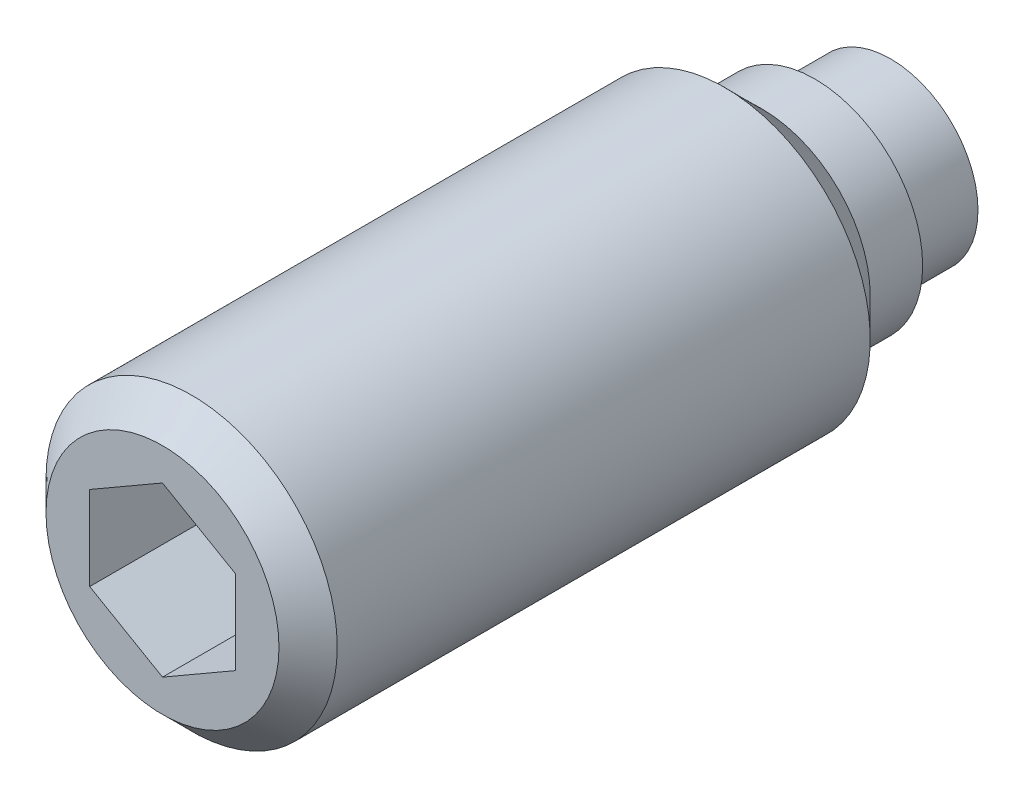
ISO-10303-21;
HEADER;
FILE_DESCRIPTION(('STEP AP214'),'2;1');
FILE_NAME('part.step','',(''),(''),'','','');
FILE_SCHEMA(('AUTOMOTIVE_DESIGN { 1 0 10303 214 1 1 1 1 }'));
ENDSEC;
DATA;
#1=APPLICATION_CONTEXT('core data for automotive mechanical design processes');
#2=APPLICATION_PROTOCOL_DEFINITION('international standard','automotive_design',2000,#1);
#3=PRODUCT_CONTEXT('',#1,'mechanical');
#4=PRODUCT('Part','Part','',(#3));
#5=PRODUCT_RELATED_PRODUCT_CATEGORY('part','',(#4));
#6=PRODUCT_DEFINITION_FORMATION('','',#4);
#7=PRODUCT_DEFINITION_CONTEXT('part definition',#1,'design');
#8=PRODUCT_DEFINITION('design','',#6,#7);
#9=PRODUCT_DEFINITION_SHAPE('','',#8);
#10=(LENGTH_UNIT() NAMED_UNIT(*) SI_UNIT(.MILLI.,.METRE.));
#11=(NAMED_UNIT(*) PLANE_ANGLE_UNIT() SI_UNIT($,.RADIAN.));
#12=(NAMED_UNIT(*) SI_UNIT($,.STERADIAN.) SOLID_ANGLE_UNIT());
#13=UNCERTAINTY_MEASURE_WITH_UNIT(LENGTH_MEASURE(1.E-05),#10,'distance_accuracy_value','');
#14=(GEOMETRIC_REPRESENTATION_CONTEXT(3) GLOBAL_UNCERTAINTY_ASSIGNED_CONTEXT((#13)) GLOBAL_UNIT_ASSIGNED_CONTEXT((#10,
#11,#12)) REPRESENTATION_CONTEXT('',''));
#15=CARTESIAN_POINT('',(0.,0.,0.));
#16=DIRECTION('',(0.,0.,1.));
#17=DIRECTION('',(1.,0.,0.));
#18=AXIS2_PLACEMENT_3D('',#15,#16,#17);
#19=CARTESIAN_POINT('',(0.,1.85,1.8));
#20=DIRECTION('',(0.,0.,1.));
#21=DIRECTION('',(1.,0.,0.));
#22=AXIS2_PLACEMENT_3D('',#19,#20,#21);
#23=PLANE('',#22);
#24=CARTESIAN_POINT('',(0.,0.,1.8));
#25=DIRECTION('',(0.,0.,-1.));
#26=DIRECTION('',(-1.,0.,0.));
#27=AXIS2_PLACEMENT_3D('',#24,#25,#26);
#28=CIRCLE('',#27,1.5);
#29=CARTESIAN_POINT('',(-1.5,0.,1.8));
#30=VERTEX_POINT('',#29);
#31=EDGE_CURVE('E124',#30,#30,#28,.T.);
#32=ORIENTED_EDGE('',*,*,#31,.F.);
#33=EDGE_LOOP('',(#32));
#34=FACE_BOUND('',#33,.T.);
#35=CARTESIAN_POINT('',(0.,0.,1.8));
#36=DIRECTION('',(0.,0.,-1.));
#37=DIRECTION('',(-1.,0.,0.));
#38=AXIS2_PLACEMENT_3D('',#35,#36,#37);
#39=CIRCLE('',#38,1.85);
#40=CARTESIAN_POINT('',(-1.85,0.,1.8));
#41=VERTEX_POINT('',#40);
#42=EDGE_CURVE('E127',#41,#41,#39,.T.);
#43=ORIENTED_EDGE('',*,*,#42,.T.);
#44=EDGE_LOOP('',(#43));
#45=FACE_BOUND('',#44,.T.);
#46=ADVANCED_FACE('F14',(#34,#45),#23,.F.);
#47=CARTESIAN_POINT('',(0.,0.,1.8));
#48=DIRECTION('',(0.,0.,-1.));
#49=DIRECTION('',(-1.,0.,0.));
#50=AXIS2_PLACEMENT_3D('',#47,#48,#49);
#51=CYLINDRICAL_SURFACE('',#50,2.5);
#52=CARTESIAN_POINT('',(0.,0.,12.5));
#53=DIRECTION('',(0.,0.,1.));
#54=DIRECTION('',(1.,0.,0.));
#55=AXIS2_PLACEMENT_3D('',#52,#53,#54);
#56=CIRCLE('',#55,2.5);
#57=CARTESIAN_POINT('',(2.5,0.,12.5));
#58=VERTEX_POINT('',#57);
#59=EDGE_CURVE('E9',#58,#58,#56,.F.);
#60=ORIENTED_EDGE('',*,*,#59,.T.);
#61=EDGE_LOOP('',(#60));
#62=FACE_BOUND('',#61,.T.);
#63=CARTESIAN_POINT('',(0.,0.,3.35));
#64=DIRECTION('',(0.,0.,-1.));
#65=DIRECTION('',(-1.,0.,0.));
#66=AXIS2_PLACEMENT_3D('',#63,#64,#65);
#67=CIRCLE('',#66,2.5);
#68=CARTESIAN_POINT('',(-2.5,0.,3.35));
#69=VERTEX_POINT('',#68);
#70=EDGE_CURVE('E133',#69,#69,#67,.T.);
#71=ORIENTED_EDGE('',*,*,#70,.F.);
#72=EDGE_LOOP('',(#71));
#73=FACE_BOUND('',#72,.T.);
#74=ADVANCED_FACE('F152',(#62,#73),#51,.T.);
#75=CARTESIAN_POINT('',(0.,0.,3.35));
#76=DIRECTION('',(0.,0.,1.));
#77=DIRECTION('',(1.,0.,0.));
#78=AXIS2_PLACEMENT_3D('',#75,#76,#77);
#79=CONICAL_SURFACE('',#78,2.5,0.785398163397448);
#80=CARTESIAN_POINT('',(0.,0.,2.7));
#81=DIRECTION('',(0.,0.,-1.));
#82=DIRECTION('',(-1.,0.,0.));
#83=AXIS2_PLACEMENT_3D('',#80,#81,#82);
#84=CIRCLE('',#83,1.85);
#85=CARTESIAN_POINT('',(-1.85,0.,2.7));
#86=VERTEX_POINT('',#85);
#87=EDGE_CURVE('E130',#86,#86,#84,.T.);
#88=ORIENTED_EDGE('',*,*,#87,.F.);
#89=EDGE_LOOP('',(#88));
#90=FACE_BOUND('',#89,.T.);
#91=ORIENTED_EDGE('',*,*,#70,.T.);
#92=EDGE_LOOP('',(#91));
#93=FACE_BOUND('',#92,.T.);
#94=ADVANCED_FACE('F159',(#90,#93),#79,.T.);
#95=CARTESIAN_POINT('',(0.,0.,1.8));
#96=DIRECTION('',(0.,0.,-1.));
#97=DIRECTION('',(-1.,0.,0.));
#98=AXIS2_PLACEMENT_3D('',#95,#96,#97);
#99=CYLINDRICAL_SURFACE('',#98,1.85);
#100=ORIENTED_EDGE('',*,*,#42,.F.);
#101=EDGE_LOOP('',(#100));
#102=FACE_BOUND('',#101,.T.);
#103=ORIENTED_EDGE('',*,*,#87,.T.);
#104=EDGE_LOOP('',(#103));
#105=FACE_BOUND('',#104,.T.);
#106=ADVANCED_FACE('F167',(#102,#105),#99,.T.);
#107=CARTESIAN_POINT('',(0.,0.,0.));
#108=DIRECTION('',(0.,0.,-1.));
#109=DIRECTION('',(-1.,0.,0.));
#110=AXIS2_PLACEMENT_3D('',#107,#108,#109);
#111=CYLINDRICAL_SURFACE('',#110,1.5);
#112=CARTESIAN_POINT('',(0.,0.,0.5));
#113=DIRECTION('',(0.,0.,-1.));
#114=DIRECTION('',(-1.,0.,0.));
#115=AXIS2_PLACEMENT_3D('',#112,#113,#114);
#116=CIRCLE('',#115,1.5);
#117=CARTESIAN_POINT('',(-1.5,0.,0.5));
#118=VERTEX_POINT('',#117);
#119=EDGE_CURVE('E116',#118,#118,#116,.T.);
#120=ORIENTED_EDGE('',*,*,#119,.F.);
#121=EDGE_LOOP('',(#120));
#122=FACE_BOUND('',#121,.T.);
#123=ORIENTED_EDGE('',*,*,#31,.T.);
#124=EDGE_LOOP('',(#123));
#125=FACE_BOUND('',#124,.T.);
#126=ADVANCED_FACE('F165',(#122,#125),#111,.T.);
#127=CARTESIAN_POINT('',(0.,0.,2.49999999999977));
#128=DIRECTION('',(0.,0.,-1.));
#129=DIRECTION('',(1.,0.,0.));
#130=AXIS2_PLACEMENT_3D('',#127,#128,#129);
#131=SPHERICAL_SURFACE('',#130,2.49999999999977);
#132=ORIENTED_EDGE('',*,*,#119,.T.);
#133=EDGE_LOOP('',(#132));
#134=FACE_BOUND('',#133,.T.);
#135=ADVANCED_FACE('F199',(#134),#131,.T.);
#136=CARTESIAN_POINT('',(0.,0.,13.));
#137=DIRECTION('',(0.,0.,1.));
#138=DIRECTION('',(1.,0.,0.));
#139=AXIS2_PLACEMENT_3D('',#136,#137,#138);
#140=PLANE('',#139);
#141=CARTESIAN_POINT('',(0.,0.,13.));
#142=DIRECTION('',(0.,0.,1.));
#143=DIRECTION('',(1.,0.,0.));
#144=AXIS2_PLACEMENT_3D('',#141,#142,#143);
#145=CIRCLE('',#144,2.);
#146=CARTESIAN_POINT('',(2.,0.,13.));
#147=VERTEX_POINT('',#146);
#148=EDGE_CURVE('E22',#147,#147,#145,.T.);
#149=ORIENTED_EDGE('',*,*,#148,.T.);
#150=EDGE_LOOP('',(#149));
#151=FACE_BOUND('',#150,.T.);
#152=DIRECTION('',(-0.866025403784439,0.5,0.));
#153=VECTOR('',#152,1.);
#154=CARTESIAN_POINT('',(1.25,0.721687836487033,13.));
#155=LINE('',#154,#153);
#156=CARTESIAN_POINT('',(1.25,0.721687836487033,13.));
#157=VERTEX_POINT('',#156);
#158=CARTESIAN_POINT('',(0.,1.44337567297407,13.));
#159=VERTEX_POINT('',#158);
#160=EDGE_CURVE('E29',#157,#159,#155,.T.);
#161=ORIENTED_EDGE('',*,*,#160,.F.);
#162=DIRECTION('',(0.,1.,0.));
#163=VECTOR('',#162,1.);
#164=CARTESIAN_POINT('',(1.25,-0.721687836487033,13.));
#165=LINE('',#164,#163);
#166=CARTESIAN_POINT('',(1.25,-0.721687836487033,13.));
#167=VERTEX_POINT('',#166);
#168=EDGE_CURVE('E112',#167,#157,#165,.T.);
#169=ORIENTED_EDGE('',*,*,#168,.F.);
#170=DIRECTION('',(0.866025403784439,0.5,0.));
#171=VECTOR('',#170,1.);
#172=CARTESIAN_POINT('',(0.,-1.44337567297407,13.));
#173=LINE('',#172,#171);
#174=CARTESIAN_POINT('',(0.,-1.44337567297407,13.));
#175=VERTEX_POINT('',#174);
#176=EDGE_CURVE('E110',#175,#167,#173,.T.);
#177=ORIENTED_EDGE('',*,*,#176,.F.);
#178=DIRECTION('',(0.866025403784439,-0.5,0.));
#179=VECTOR('',#178,1.);
#180=CARTESIAN_POINT('',(-1.25,-0.721687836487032,13.));
#181=LINE('',#180,#179);
#182=CARTESIAN_POINT('',(-1.25,-0.721687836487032,13.));
#183=VERTEX_POINT('',#182);
#184=EDGE_CURVE('E77',#183,#175,#181,.T.);
#185=ORIENTED_EDGE('',*,*,#184,.F.);
#186=DIRECTION('',(0.,-1.,0.));
#187=VECTOR('',#186,1.);
#188=CARTESIAN_POINT('',(-1.25,0.721687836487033,13.));
#189=LINE('',#188,#187);
#190=CARTESIAN_POINT('',(-1.25,0.721687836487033,13.));
#191=VERTEX_POINT('',#190);
#192=EDGE_CURVE('E106',#191,#183,#189,.T.);
#193=ORIENTED_EDGE('',*,*,#192,.F.);
#194=DIRECTION('',(-0.866025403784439,-0.5,0.));
#195=VECTOR('',#194,1.);
#196=CARTESIAN_POINT('',(0.,1.44337567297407,13.));
#197=LINE('',#196,#195);
#198=EDGE_CURVE('E103',#159,#191,#197,.T.);
#199=ORIENTED_EDGE('',*,*,#198,.F.);
#200=EDGE_LOOP('',(#161,#169,#177,#185,#193,#199));
#201=FACE_BOUND('',#200,.T.);
#202=ADVANCED_FACE('F138',(#151,#201),#140,.T.);
#203=CARTESIAN_POINT('',(1.25,0.721687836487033,10.));
#204=DIRECTION('',(0.5,0.866025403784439,0.));
#205=DIRECTION('',(-0.866025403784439,0.5,0.));
#206=AXIS2_PLACEMENT_3D('',#203,#204,#205);
#207=PLANE('',#206);
#208=ORIENTED_EDGE('',*,*,#160,.T.);
#209=DIRECTION('',(0.,0.,1.));
#210=VECTOR('',#209,1.);
#211=CARTESIAN_POINT('',(0.,1.44337567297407,10.));
#212=LINE('',#211,#210);
#213=CARTESIAN_POINT('',(0.,1.44337567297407,10.));
#214=VERTEX_POINT('',#213);
#215=EDGE_CURVE('E59',#214,#159,#212,.T.);
#216=ORIENTED_EDGE('',*,*,#215,.F.);
#217=DIRECTION('',(-0.866025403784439,0.5,0.));
#218=VECTOR('',#217,1.);
#219=CARTESIAN_POINT('',(1.25,0.721687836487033,10.));
#220=LINE('',#219,#218);
#221=CARTESIAN_POINT('',(1.25,0.721687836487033,10.));
#222=VERTEX_POINT('',#221);
#223=EDGE_CURVE('E114',#222,#214,#220,.T.);
#224=ORIENTED_EDGE('',*,*,#223,.F.);
#225=DIRECTION('',(0.,0.,1.));
#226=VECTOR('',#225,1.);
#227=CARTESIAN_POINT('',(1.25,0.721687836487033,10.));
#228=LINE('',#227,#226);
#229=EDGE_CURVE('E37',#222,#157,#228,.T.);
#230=ORIENTED_EDGE('',*,*,#229,.T.);
#231=EDGE_LOOP('',(#208,#216,#224,#230));
#232=FACE_BOUND('',#231,.T.);
#233=ADVANCED_FACE('F214',(#232),#207,.F.);
#234=CARTESIAN_POINT('',(1.25,-0.721687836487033,10.));
#235=DIRECTION('',(1.,0.,0.));
#236=DIRECTION('',(0.,0.,-1.));
#237=AXIS2_PLACEMENT_3D('',#234,#235,#236);
#238=PLANE('',#237);
#239=ORIENTED_EDGE('',*,*,#168,.T.);
#240=ORIENTED_EDGE('',*,*,#229,.F.);
#241=DIRECTION('',(0.,1.,0.));
#242=VECTOR('',#241,1.);
#243=CARTESIAN_POINT('',(1.25,-0.721687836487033,10.));
#244=LINE('',#243,#242);
#245=CARTESIAN_POINT('',(1.25,-0.721687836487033,10.));
#246=VERTEX_POINT('',#245);
#247=EDGE_CURVE('E89',#246,#222,#244,.T.);
#248=ORIENTED_EDGE('',*,*,#247,.F.);
#249=DIRECTION('',(0.,0.,1.));
#250=VECTOR('',#249,1.);
#251=CARTESIAN_POINT('',(1.25,-0.721687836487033,10.));
#252=LINE('',#251,#250);
#253=EDGE_CURVE('E81',#246,#167,#252,.T.);
#254=ORIENTED_EDGE('',*,*,#253,.T.);
#255=EDGE_LOOP('',(#239,#240,#248,#254));
#256=FACE_BOUND('',#255,.T.);
#257=ADVANCED_FACE('F222',(#256),#238,.F.);
#258=CARTESIAN_POINT('',(0.,-1.44337567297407,10.));
#259=DIRECTION('',(0.5,-0.866025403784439,0.));
#260=DIRECTION('',(0.866025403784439,0.5,0.));
#261=AXIS2_PLACEMENT_3D('',#258,#259,#260);
#262=PLANE('',#261);
#263=ORIENTED_EDGE('',*,*,#176,.T.);
#264=ORIENTED_EDGE('',*,*,#253,.F.);
#265=DIRECTION('',(0.866025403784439,0.5,0.));
#266=VECTOR('',#265,1.);
#267=CARTESIAN_POINT('',(0.,-1.44337567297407,10.));
#268=LINE('',#267,#266);
#269=CARTESIAN_POINT('',(0.,-1.44337567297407,10.));
#270=VERTEX_POINT('',#269);
#271=EDGE_CURVE('E85',#270,#246,#268,.T.);
#272=ORIENTED_EDGE('',*,*,#271,.F.);
#273=DIRECTION('',(0.,0.,1.));
#274=VECTOR('',#273,1.);
#275=CARTESIAN_POINT('',(0.,-1.44337567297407,10.));
#276=LINE('',#275,#274);
#277=EDGE_CURVE('E70',#270,#175,#276,.T.);
#278=ORIENTED_EDGE('',*,*,#277,.T.);
#279=EDGE_LOOP('',(#263,#264,#272,#278));
#280=FACE_BOUND('',#279,.T.);
#281=ADVANCED_FACE('F86',(#280),#262,.F.);
#282=CARTESIAN_POINT('',(-1.25,-0.721687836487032,10.));
#283=DIRECTION('',(-0.5,-0.866025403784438,0.));
#284=DIRECTION('',(0.866025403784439,-0.5,0.));
#285=AXIS2_PLACEMENT_3D('',#282,#283,#284);
#286=PLANE('',#285);
#287=ORIENTED_EDGE('',*,*,#184,.T.);
#288=ORIENTED_EDGE('',*,*,#277,.F.);
#289=DIRECTION('',(0.866025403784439,-0.5,0.));
#290=VECTOR('',#289,1.);
#291=CARTESIAN_POINT('',(-1.25,-0.721687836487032,10.));
#292=LINE('',#291,#290);
#293=CARTESIAN_POINT('',(-1.25,-0.721687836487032,10.));
#294=VERTEX_POINT('',#293);
#295=EDGE_CURVE('E74',#294,#270,#292,.T.);
#296=ORIENTED_EDGE('',*,*,#295,.F.);
#297=DIRECTION('',(0.,0.,1.));
#298=VECTOR('',#297,1.);
#299=CARTESIAN_POINT('',(-1.25,-0.721687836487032,10.));
#300=LINE('',#299,#298);
#301=EDGE_CURVE('E82',#294,#183,#300,.T.);
#302=ORIENTED_EDGE('',*,*,#301,.T.);
#303=EDGE_LOOP('',(#287,#288,#296,#302));
#304=FACE_BOUND('',#303,.T.);
#305=ADVANCED_FACE('F72',(#304),#286,.F.);
#306=CARTESIAN_POINT('',(-1.25,0.721687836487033,10.));
#307=DIRECTION('',(-1.,0.,0.));
#308=DIRECTION('',(0.,-1.,0.));
#309=AXIS2_PLACEMENT_3D('',#306,#307,#308);
#310=PLANE('',#309);
#311=ORIENTED_EDGE('',*,*,#192,.T.);
#312=ORIENTED_EDGE('',*,*,#301,.F.);
#313=DIRECTION('',(0.,-1.,0.));
#314=VECTOR('',#313,1.);
#315=CARTESIAN_POINT('',(-1.25,0.721687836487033,10.));
#316=LINE('',#315,#314);
#317=CARTESIAN_POINT('',(-1.25,0.721687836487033,10.));
#318=VERTEX_POINT('',#317);
#319=EDGE_CURVE('E95',#318,#294,#316,.T.);
#320=ORIENTED_EDGE('',*,*,#319,.F.);
#321=DIRECTION('',(0.,0.,1.));
#322=VECTOR('',#321,1.);
#323=CARTESIAN_POINT('',(-1.25,0.721687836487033,10.));
#324=LINE('',#323,#322);
#325=EDGE_CURVE('E119',#318,#191,#324,.T.);
#326=ORIENTED_EDGE('',*,*,#325,.T.);
#327=EDGE_LOOP('',(#311,#312,#320,#326));
#328=FACE_BOUND('',#327,.T.);
#329=ADVANCED_FACE('F244',(#328),#310,.F.);
#330=CARTESIAN_POINT('',(0.,1.44337567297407,10.));
#331=DIRECTION('',(-0.5,0.866025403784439,0.));
#332=DIRECTION('',(-0.866025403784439,-0.5,0.));
#333=AXIS2_PLACEMENT_3D('',#330,#331,#332);
#334=PLANE('',#333);
#335=ORIENTED_EDGE('',*,*,#198,.T.);
#336=ORIENTED_EDGE('',*,*,#325,.F.);
#337=DIRECTION('',(-0.866025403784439,-0.5,0.));
#338=VECTOR('',#337,1.);
#339=CARTESIAN_POINT('',(0.,1.44337567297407,10.));
#340=LINE('',#339,#338);
#341=EDGE_CURVE('E97',#214,#318,#340,.T.);
#342=ORIENTED_EDGE('',*,*,#341,.F.);
#343=ORIENTED_EDGE('',*,*,#215,.T.);
#344=EDGE_LOOP('',(#335,#336,#342,#343));
#345=FACE_BOUND('',#344,.T.);
#346=ADVANCED_FACE('F148',(#345),#334,.F.);
#347=CARTESIAN_POINT('',(0.,0.,10.));
#348=DIRECTION('',(0.,0.,1.));
#349=DIRECTION('',(1.,0.,0.));
#350=AXIS2_PLACEMENT_3D('',#347,#348,#349);
#351=PLANE('',#350);
#352=ORIENTED_EDGE('',*,*,#223,.T.);
#353=ORIENTED_EDGE('',*,*,#341,.T.);
#354=ORIENTED_EDGE('',*,*,#319,.T.);
#355=ORIENTED_EDGE('',*,*,#295,.T.);
#356=ORIENTED_EDGE('',*,*,#271,.T.);
#357=ORIENTED_EDGE('',*,*,#247,.T.);
#358=EDGE_LOOP('',(#352,#353,#354,#355,#356,#357));
#359=FACE_BOUND('',#358,.T.);
#360=ADVANCED_FACE('F92',(#359),#351,.T.);
#361=CARTESIAN_POINT('',(0.,0.,13.));
#362=DIRECTION('',(0.,0.,-1.));
#363=DIRECTION('',(-1.,0.,0.));
#364=AXIS2_PLACEMENT_3D('',#361,#362,#363);
#365=CONICAL_SURFACE('',#364,2.,0.785398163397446);
#366=ORIENTED_EDGE('',*,*,#59,.F.);
#367=EDGE_LOOP('',(#366));
#368=FACE_BOUND('',#367,.T.);
#369=ORIENTED_EDGE('',*,*,#148,.F.);
#370=EDGE_LOOP('',(#369));
#371=FACE_BOUND('',#370,.T.);
#372=ADVANCED_FACE('F16',(#368,#371),#365,.T.);
#373=CLOSED_SHELL('',(#46,#74,#94,#106,#126,#135,#202,#233,#257,#281,#305,#329,#346,#360,#372));
#374=MANIFOLD_SOLID_BREP('B1',#373);
#375=ADVANCED_BREP_SHAPE_REPRESENTATION('',(#18,#374),#14);
#376=SHAPE_DEFINITION_REPRESENTATION(#9,#375);
ENDSEC;
END-ISO-10303-21;
